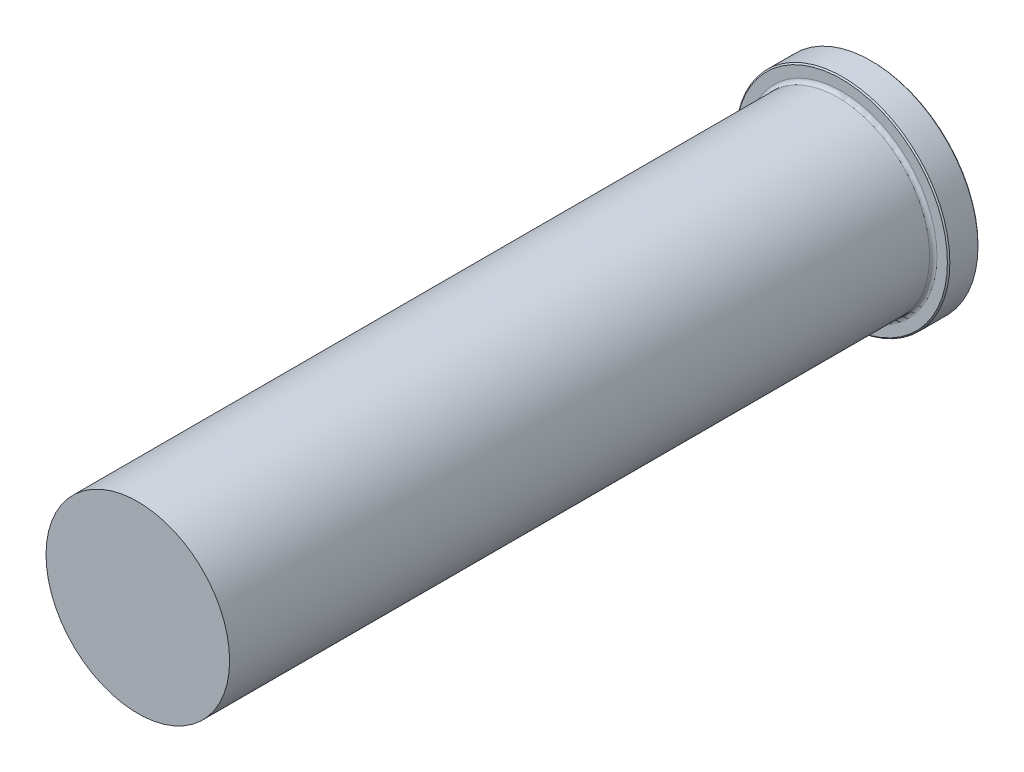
ISO-10303-21;
HEADER;
FILE_DESCRIPTION(('STEP AP214'),'2;1');
FILE_NAME('part.step','',(''),(''),'','','');
FILE_SCHEMA(('AUTOMOTIVE_DESIGN { 1 0 10303 214 1 1 1 1 }'));
ENDSEC;
DATA;
#1=APPLICATION_CONTEXT('core data for automotive mechanical design processes');
#2=APPLICATION_PROTOCOL_DEFINITION('international standard','automotive_design',2000,#1);
#3=PRODUCT_CONTEXT('',#1,'mechanical');
#4=PRODUCT('Part','Part','',(#3));
#5=PRODUCT_RELATED_PRODUCT_CATEGORY('part','',(#4));
#6=PRODUCT_DEFINITION_FORMATION('','',#4);
#7=PRODUCT_DEFINITION_CONTEXT('part definition',#1,'design');
#8=PRODUCT_DEFINITION('design','',#6,#7);
#9=PRODUCT_DEFINITION_SHAPE('','',#8);
#10=(LENGTH_UNIT() NAMED_UNIT(*) SI_UNIT(.MILLI.,.METRE.));
#11=(NAMED_UNIT(*) PLANE_ANGLE_UNIT() SI_UNIT($,.RADIAN.));
#12=(NAMED_UNIT(*) SI_UNIT($,.STERADIAN.) SOLID_ANGLE_UNIT());
#13=UNCERTAINTY_MEASURE_WITH_UNIT(LENGTH_MEASURE(1.E-05),#10,'distance_accuracy_value','');
#14=(GEOMETRIC_REPRESENTATION_CONTEXT(3) GLOBAL_UNCERTAINTY_ASSIGNED_CONTEXT((#13)) GLOBAL_UNIT_ASSIGNED_CONTEXT((#10,
#11,#12)) REPRESENTATION_CONTEXT('',''));
#15=CARTESIAN_POINT('',(0.,0.,0.));
#16=DIRECTION('',(0.,0.,1.));
#17=DIRECTION('',(1.,0.,0.));
#18=AXIS2_PLACEMENT_3D('',#15,#16,#17);
#19=CARTESIAN_POINT('',(0.,0.,0.));
#20=DIRECTION('',(0.,0.,-1.));
#21=DIRECTION('',(-1.,0.,0.));
#22=AXIS2_PLACEMENT_3D('',#19,#20,#21);
#23=PLANE('',#22);
#24=CARTESIAN_POINT('',(0.,0.,0.));
#25=DIRECTION('',(0.,0.,-1.));
#26=DIRECTION('',(-1.,0.,0.));
#27=AXIS2_PLACEMENT_3D('',#24,#25,#26);
#28=CIRCLE('',#27,21.971);
#29=CARTESIAN_POINT('',(-21.971,0.,0.));
#30=VERTEX_POINT('',#29);
#31=EDGE_CURVE('E50',#30,#30,#28,.T.);
#32=ORIENTED_EDGE('',*,*,#31,.T.);
#33=EDGE_LOOP('',(#32));
#34=FACE_BOUND('',#33,.T.);
#35=ADVANCED_FACE('F35',(#34),#23,.T.);
#36=CARTESIAN_POINT('',(0.,0.,0.));
#37=DIRECTION('',(0.,0.,-1.));
#38=DIRECTION('',(-1.,0.,0.));
#39=AXIS2_PLACEMENT_3D('',#36,#37,#38);
#40=CYLINDRICAL_SURFACE('',#39,22.225);
#41=CARTESIAN_POINT('',(0.,0.,0.253999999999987));
#42=DIRECTION('',(0.,0.,-1.));
#43=DIRECTION('',(-1.,0.,0.));
#44=AXIS2_PLACEMENT_3D('',#41,#42,#43);
#45=CIRCLE('',#44,22.225);
#46=CARTESIAN_POINT('',(-22.225,0.,0.253999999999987));
#47=VERTEX_POINT('',#46);
#48=EDGE_CURVE('E42',#47,#47,#45,.F.);
#49=ORIENTED_EDGE('',*,*,#48,.T.);
#50=EDGE_LOOP('',(#49));
#51=FACE_BOUND('',#50,.T.);
#52=CARTESIAN_POINT('',(0.,0.,6.09600000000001));
#53=DIRECTION('',(0.,0.,1.));
#54=DIRECTION('',(1.,0.,0.));
#55=AXIS2_PLACEMENT_3D('',#52,#53,#54);
#56=CIRCLE('',#55,22.225);
#57=CARTESIAN_POINT('',(22.225,0.,6.09600000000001));
#58=VERTEX_POINT('',#57);
#59=EDGE_CURVE('E46',#58,#58,#56,.F.);
#60=ORIENTED_EDGE('',*,*,#59,.T.);
#61=EDGE_LOOP('',(#60));
#62=FACE_BOUND('',#61,.T.);
#63=ADVANCED_FACE('F82',(#51,#62),#40,.T.);
#64=CARTESIAN_POINT('',(0.,22.225,6.35));
#65=DIRECTION('',(0.,0.,1.));
#66=DIRECTION('',(1.,0.,0.));
#67=AXIS2_PLACEMENT_3D('',#64,#65,#66);
#68=PLANE('',#67);
#69=CARTESIAN_POINT('',(0.,0.,6.35));
#70=DIRECTION('',(0.,0.,1.));
#71=DIRECTION('',(1.,0.,0.));
#72=AXIS2_PLACEMENT_3D('',#69,#70,#71);
#73=CIRCLE('',#72,21.971);
#74=CARTESIAN_POINT('',(21.971,0.,6.35));
#75=VERTEX_POINT('',#74);
#76=EDGE_CURVE('E10',#75,#75,#73,.T.);
#77=ORIENTED_EDGE('',*,*,#76,.T.);
#78=EDGE_LOOP('',(#77));
#79=FACE_BOUND('',#78,.T.);
#80=CARTESIAN_POINT('',(0.,0.,6.35));
#81=DIRECTION('',(0.,0.,1.));
#82=DIRECTION('',(1.,0.,0.));
#83=AXIS2_PLACEMENT_3D('',#80,#81,#82);
#84=CIRCLE('',#83,19.812);
#85=CARTESIAN_POINT('',(19.812,0.,6.35));
#86=VERTEX_POINT('',#85);
#87=EDGE_CURVE('E58',#86,#86,#84,.F.);
#88=ORIENTED_EDGE('',*,*,#87,.T.);
#89=EDGE_LOOP('',(#88));
#90=FACE_BOUND('',#89,.T.);
#91=ADVANCED_FACE('F78',(#79,#90),#68,.T.);
#92=CARTESIAN_POINT('',(0.,0.,0.));
#93=DIRECTION('',(0.,0.,-1.));
#94=DIRECTION('',(-1.,0.,0.));
#95=AXIS2_PLACEMENT_3D('',#92,#93,#94);
#96=CYLINDRICAL_SURFACE('',#95,19.05);
#97=CARTESIAN_POINT('',(0.,0.,7.112));
#98=DIRECTION('',(0.,0.,1.));
#99=DIRECTION('',(1.,0.,0.));
#100=AXIS2_PLACEMENT_3D('',#97,#98,#99);
#101=CIRCLE('',#100,19.05);
#102=CARTESIAN_POINT('',(19.05,0.,7.112));
#103=VERTEX_POINT('',#102);
#104=EDGE_CURVE('E55',#103,#103,#101,.T.);
#105=ORIENTED_EDGE('',*,*,#104,.T.);
#106=EDGE_LOOP('',(#105));
#107=FACE_BOUND('',#106,.T.);
#108=CARTESIAN_POINT('',(0.,0.,152.4));
#109=DIRECTION('',(0.,0.,-1.));
#110=DIRECTION('',(-1.,0.,0.));
#111=AXIS2_PLACEMENT_3D('',#108,#109,#110);
#112=CIRCLE('',#111,19.05);
#113=CARTESIAN_POINT('',(-19.05,0.,152.4));
#114=VERTEX_POINT('',#113);
#115=EDGE_CURVE('E61',#114,#114,#112,.T.);
#116=ORIENTED_EDGE('',*,*,#115,.T.);
#117=EDGE_LOOP('',(#116));
#118=FACE_BOUND('',#117,.T.);
#119=ADVANCED_FACE('F65',(#107,#118),#96,.T.);
#120=CARTESIAN_POINT('',(0.,19.05,152.4));
#121=DIRECTION('',(0.,0.,1.));
#122=DIRECTION('',(1.,0.,0.));
#123=AXIS2_PLACEMENT_3D('',#120,#121,#122);
#124=PLANE('',#123);
#125=ORIENTED_EDGE('',*,*,#115,.F.);
#126=EDGE_LOOP('',(#125));
#127=FACE_BOUND('',#126,.T.);
#128=ADVANCED_FACE('F67',(#127),#124,.T.);
#129=CARTESIAN_POINT('',(0.,0.,7.112));
#130=DIRECTION('',(0.,0.,1.));
#131=DIRECTION('',(1.,0.,0.));
#132=AXIS2_PLACEMENT_3D('',#129,#130,#131);
#133=TOROIDAL_SURFACE('',#132,19.812,0.762);
#134=ORIENTED_EDGE('',*,*,#104,.F.);
#135=EDGE_LOOP('',(#134));
#136=FACE_BOUND('',#135,.T.);
#137=ORIENTED_EDGE('',*,*,#87,.F.);
#138=EDGE_LOOP('',(#137));
#139=FACE_BOUND('',#138,.T.);
#140=ADVANCED_FACE('F69',(#136,#139),#133,.F.);
#141=CARTESIAN_POINT('',(0.,0.,0.));
#142=DIRECTION('',(0.,0.,1.));
#143=DIRECTION('',(1.,0.,0.));
#144=AXIS2_PLACEMENT_3D('',#141,#142,#143);
#145=CONICAL_SURFACE('',#144,21.971,0.785398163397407);
#146=ORIENTED_EDGE('',*,*,#48,.F.);
#147=EDGE_LOOP('',(#146));
#148=FACE_BOUND('',#147,.T.);
#149=ORIENTED_EDGE('',*,*,#31,.F.);
#150=EDGE_LOOP('',(#149));
#151=FACE_BOUND('',#150,.T.);
#152=ADVANCED_FACE('F75',(#148,#151),#145,.T.);
#153=CARTESIAN_POINT('',(0.,0.,6.09600000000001));
#154=DIRECTION('',(0.,0.,-1.));
#155=DIRECTION('',(-1.,0.,0.));
#156=AXIS2_PLACEMENT_3D('',#153,#154,#155);
#157=CONICAL_SURFACE('',#156,22.225,0.785398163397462);
#158=ORIENTED_EDGE('',*,*,#76,.F.);
#159=EDGE_LOOP('',(#158));
#160=FACE_BOUND('',#159,.T.);
#161=ORIENTED_EDGE('',*,*,#59,.F.);
#162=EDGE_LOOP('',(#161));
#163=FACE_BOUND('',#162,.T.);
#164=ADVANCED_FACE('F37',(#160,#163),#157,.T.);
#165=CLOSED_SHELL('',(#35,#63,#91,#119,#128,#140,#152,#164));
#166=MANIFOLD_SOLID_BREP('B2',#165);
#167=ADVANCED_BREP_SHAPE_REPRESENTATION('',(#18,#166),#14);
#168=SHAPE_DEFINITION_REPRESENTATION(#9,#167);
ENDSEC;
END-ISO-10303-21;
